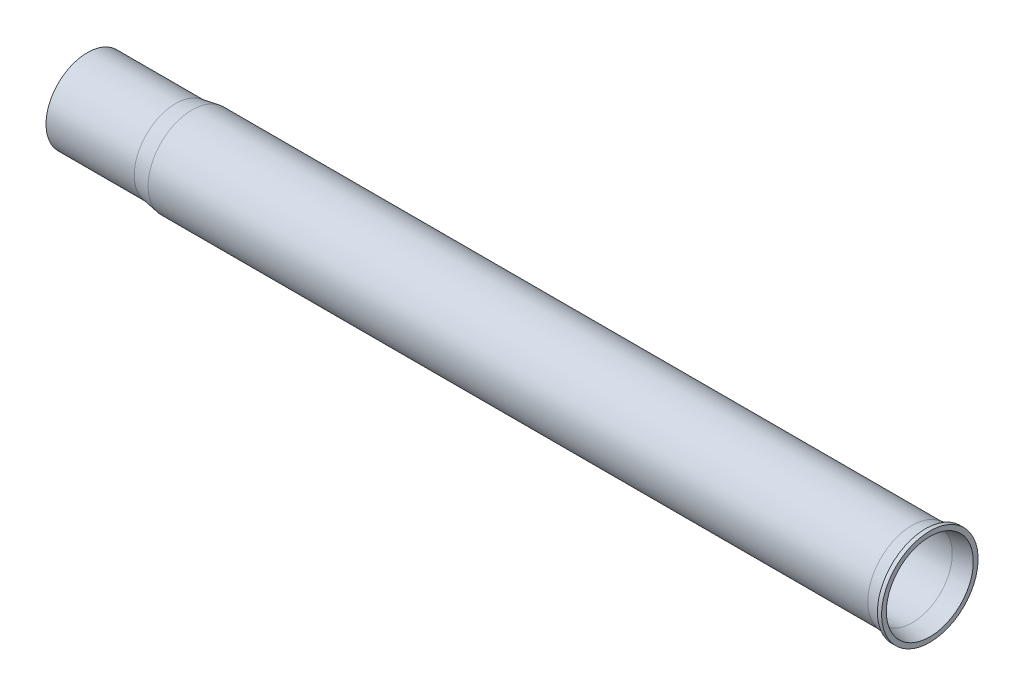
from build123d import *


with BuildPart() as part:
    # Esquisse1 → Base-R_volution (revolve)
    with BuildSketch(Plane.XY, mode=Mode.PRIVATE) as base_r_volution_sk:
        Polygon((0, 15), (32, 15), (38, 16), (299, 16), (304, 17), (304, 17.5), (305.5, 17.5), (305.5, 15.770294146), (299.14852927, 14.5), (38.124143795, 14.5), (32.124143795, 13.5), (0, 13.5), align=None)
    revolve(base_r_volution_sk.sketch.rotate(Axis((0, 0, 0), (1, 0, 0)), 90), axis=Axis((0, 0, 0), (1, 0, 0)))


solid = part.part
